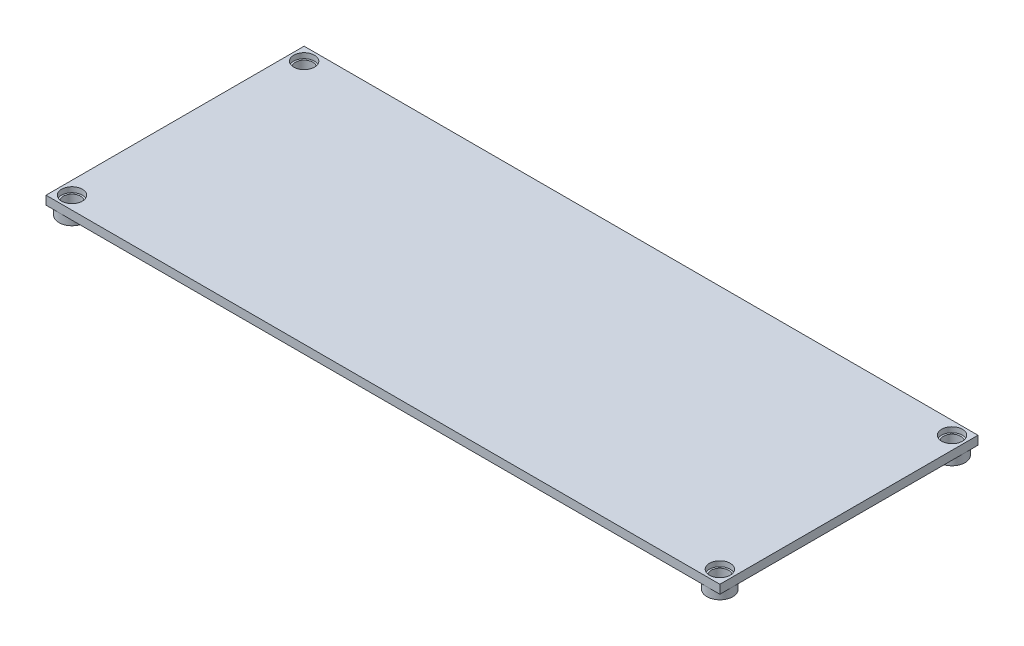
ISO-10303-21;
HEADER;
FILE_DESCRIPTION(('STEP AP214'),'2;1');
FILE_NAME('part.step','',(''),(''),'','','');
FILE_SCHEMA(('AUTOMOTIVE_DESIGN { 1 0 10303 214 1 1 1 1 }'));
ENDSEC;
DATA;
#1=APPLICATION_CONTEXT('core data for automotive mechanical design processes');
#2=APPLICATION_PROTOCOL_DEFINITION('international standard','automotive_design',2000,#1);
#3=PRODUCT_CONTEXT('',#1,'mechanical');
#4=PRODUCT('Part','Part','',(#3));
#5=PRODUCT_RELATED_PRODUCT_CATEGORY('part','',(#4));
#6=PRODUCT_DEFINITION_FORMATION('','',#4);
#7=PRODUCT_DEFINITION_CONTEXT('part definition',#1,'design');
#8=PRODUCT_DEFINITION('design','',#6,#7);
#9=PRODUCT_DEFINITION_SHAPE('','',#8);
#10=(LENGTH_UNIT() NAMED_UNIT(*) SI_UNIT(.MILLI.,.METRE.));
#11=(NAMED_UNIT(*) PLANE_ANGLE_UNIT() SI_UNIT($,.RADIAN.));
#12=(NAMED_UNIT(*) SI_UNIT($,.STERADIAN.) SOLID_ANGLE_UNIT());
#13=UNCERTAINTY_MEASURE_WITH_UNIT(LENGTH_MEASURE(1.E-05),#10,'distance_accuracy_value','');
#14=(GEOMETRIC_REPRESENTATION_CONTEXT(3) GLOBAL_UNCERTAINTY_ASSIGNED_CONTEXT((#13)) GLOBAL_UNIT_ASSIGNED_CONTEXT((#10,
#11,#12)) REPRESENTATION_CONTEXT('',''));
#15=CARTESIAN_POINT('',(0.,0.,0.));
#16=DIRECTION('',(0.,0.,1.));
#17=DIRECTION('',(1.,0.,0.));
#18=AXIS2_PLACEMENT_3D('',#15,#16,#17);
#19=CARTESIAN_POINT('',(0.,0.,0.));
#20=DIRECTION('',(0.,-1.,0.));
#21=DIRECTION('',(0.,0.,-1.));
#22=AXIS2_PLACEMENT_3D('',#19,#20,#21);
#23=PLANE('',#22);
#24=DIRECTION('',(1.,0.,0.));
#25=VECTOR('',#24,1.);
#26=CARTESIAN_POINT('',(-97.25,0.,37.25));
#27=LINE('',#26,#25);
#28=CARTESIAN_POINT('',(93.4999999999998,0.,37.25));
#29=VERTEX_POINT('',#28);
#30=CARTESIAN_POINT('',(97.25,0.,37.25));
#31=VERTEX_POINT('',#30);
#32=EDGE_CURVE('E109',#29,#31,#27,.T.);
#33=ORIENTED_EDGE('',*,*,#32,.F.);
#34=CARTESIAN_POINT('',(93.4999999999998,0.,33.5000000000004));
#35=DIRECTION('',(0.,-1.,0.));
#36=DIRECTION('',(0.,0.,-1.));
#37=AXIS2_PLACEMENT_3D('',#34,#35,#36);
#38=CIRCLE('',#37,3.75000000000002);
#39=CARTESIAN_POINT('',(97.25,0.,33.5000000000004));
#40=VERTEX_POINT('',#39);
#41=EDGE_CURVE('E49',#40,#29,#38,.T.);
#42=ORIENTED_EDGE('',*,*,#41,.F.);
#43=DIRECTION('',(0.,0.,-1.));
#44=VECTOR('',#43,1.);
#45=CARTESIAN_POINT('',(97.25,0.,37.25));
#46=LINE('',#45,#44);
#47=EDGE_CURVE('E108',#31,#40,#46,.T.);
#48=ORIENTED_EDGE('',*,*,#47,.F.);
#49=EDGE_LOOP('',(#33,#42,#48));
#50=FACE_BOUND('',#49,.T.);
#51=ADVANCED_FACE('F35',(#50),#23,.T.);
#52=CARTESIAN_POINT('',(97.2499999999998,0.,-33.5000000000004));
#53=VERTEX_POINT('',#52);
#54=EDGE_CURVE('E112',#40,#53,#46,.T.);
#55=ORIENTED_EDGE('',*,*,#54,.F.);
#56=EDGE_CURVE('E97',#29,#40,#38,.T.);
#57=ORIENTED_EDGE('',*,*,#56,.F.);
#58=CARTESIAN_POINT('',(-93.5,0.,37.25));
#59=VERTEX_POINT('',#58);
#60=EDGE_CURVE('E271',#59,#29,#27,.T.);
#61=ORIENTED_EDGE('',*,*,#60,.F.);
#62=CARTESIAN_POINT('',(-93.5,0.,33.5));
#63=DIRECTION('',(0.,-1.,0.));
#64=DIRECTION('',(0.,0.,-1.));
#65=AXIS2_PLACEMENT_3D('',#62,#63,#64);
#66=CIRCLE('',#65,3.75000000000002);
#67=CARTESIAN_POINT('',(-97.25,0.,33.5));
#68=VERTEX_POINT('',#67);
#69=EDGE_CURVE('E43',#68,#59,#66,.T.);
#70=ORIENTED_EDGE('',*,*,#69,.F.);
#71=DIRECTION('',(0.,0.,1.));
#72=VECTOR('',#71,1.);
#73=CARTESIAN_POINT('',(-97.25,0.,37.25));
#74=LINE('',#73,#72);
#75=CARTESIAN_POINT('',(-97.25,0.,-33.5));
#76=VERTEX_POINT('',#75);
#77=EDGE_CURVE('E273',#76,#68,#74,.T.);
#78=ORIENTED_EDGE('',*,*,#77,.F.);
#79=CARTESIAN_POINT('',(-93.5,0.,-33.5));
#80=DIRECTION('',(0.,-1.,0.));
#81=DIRECTION('',(0.,0.,-1.));
#82=AXIS2_PLACEMENT_3D('',#79,#80,#81);
#83=CIRCLE('',#82,3.75000000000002);
#84=CARTESIAN_POINT('',(-93.5,0.,-37.25));
#85=VERTEX_POINT('',#84);
#86=EDGE_CURVE('E188',#85,#76,#83,.T.);
#87=ORIENTED_EDGE('',*,*,#86,.F.);
#88=DIRECTION('',(-1.,0.,0.));
#89=VECTOR('',#88,1.);
#90=CARTESIAN_POINT('',(-97.25,0.,-37.25));
#91=LINE('',#90,#89);
#92=CARTESIAN_POINT('',(93.4999999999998,0.,-37.25));
#93=VERTEX_POINT('',#92);
#94=EDGE_CURVE('E125',#93,#85,#91,.T.);
#95=ORIENTED_EDGE('',*,*,#94,.F.);
#96=CARTESIAN_POINT('',(93.4999999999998,0.,-33.5000000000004));
#97=DIRECTION('',(0.,-1.,0.));
#98=DIRECTION('',(0.,0.,-1.));
#99=AXIS2_PLACEMENT_3D('',#96,#97,#98);
#100=CIRCLE('',#99,3.75000000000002);
#101=EDGE_CURVE('E11',#93,#53,#100,.F.);
#102=ORIENTED_EDGE('',*,*,#101,.T.);
#103=EDGE_LOOP('',(#55,#57,#61,#70,#78,#87,#95,#102));
#104=FACE_BOUND('',#103,.T.);
#105=ADVANCED_FACE('F113',(#104),#23,.T.);
#106=CARTESIAN_POINT('',(-97.25,0.,-37.25));
#107=VERTEX_POINT('',#106);
#108=EDGE_CURVE('E124',#85,#107,#91,.T.);
#109=ORIENTED_EDGE('',*,*,#108,.F.);
#110=EDGE_CURVE('E56',#76,#85,#83,.T.);
#111=ORIENTED_EDGE('',*,*,#110,.F.);
#112=EDGE_CURVE('E272',#107,#76,#74,.T.);
#113=ORIENTED_EDGE('',*,*,#112,.F.);
#114=EDGE_LOOP('',(#109,#111,#113));
#115=FACE_BOUND('',#114,.T.);
#116=ADVANCED_FACE('F278',(#115),#23,.T.);
#117=CARTESIAN_POINT('',(97.25,0.,-37.25));
#118=VERTEX_POINT('',#117);
#119=EDGE_CURVE('E118',#53,#118,#46,.T.);
#120=ORIENTED_EDGE('',*,*,#119,.F.);
#121=CARTESIAN_POINT('',(93.4999999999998,0.,-33.5000000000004));
#122=DIRECTION('',(0.,-1.,0.));
#123=DIRECTION('',(0.,0.,-1.));
#124=AXIS2_PLACEMENT_3D('',#121,#122,#123);
#125=CIRCLE('',#124,3.75000000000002);
#126=EDGE_CURVE('E181',#93,#53,#125,.T.);
#127=ORIENTED_EDGE('',*,*,#126,.F.);
#128=EDGE_CURVE('E127',#118,#93,#91,.T.);
#129=ORIENTED_EDGE('',*,*,#128,.F.);
#130=EDGE_LOOP('',(#120,#127,#129));
#131=FACE_BOUND('',#130,.T.);
#132=ADVANCED_FACE('F280',(#131),#23,.T.);
#133=EDGE_CURVE('E169',#59,#68,#66,.T.);
#134=ORIENTED_EDGE('',*,*,#133,.F.);
#135=CARTESIAN_POINT('',(-97.25,0.,37.25));
#136=VERTEX_POINT('',#135);
#137=EDGE_CURVE('E148',#136,#59,#27,.T.);
#138=ORIENTED_EDGE('',*,*,#137,.F.);
#139=EDGE_CURVE('E268',#68,#136,#74,.T.);
#140=ORIENTED_EDGE('',*,*,#139,.F.);
#141=EDGE_LOOP('',(#134,#138,#140));
#142=FACE_BOUND('',#141,.T.);
#143=ADVANCED_FACE('F276',(#142),#23,.T.);
#144=CARTESIAN_POINT('',(97.25,2.5,37.25));
#145=DIRECTION('',(-1.,0.,0.));
#146=DIRECTION('',(0.,0.,1.));
#147=AXIS2_PLACEMENT_3D('',#144,#145,#146);
#148=PLANE('',#147);
#149=ORIENTED_EDGE('',*,*,#47,.T.);
#150=ORIENTED_EDGE('',*,*,#54,.T.);
#151=ORIENTED_EDGE('',*,*,#119,.T.);
#152=DIRECTION('',(0.,-1.,0.));
#153=VECTOR('',#152,1.);
#154=CARTESIAN_POINT('',(97.25,2.5,-37.25));
#155=LINE('',#154,#153);
#156=CARTESIAN_POINT('',(97.25,2.5,-37.25));
#157=VERTEX_POINT('',#156);
#158=EDGE_CURVE('E163',#157,#118,#155,.T.);
#159=ORIENTED_EDGE('',*,*,#158,.F.);
#160=DIRECTION('',(0.,0.,-1.));
#161=VECTOR('',#160,1.);
#162=CARTESIAN_POINT('',(97.25,2.5,37.25));
#163=LINE('',#162,#161);
#164=CARTESIAN_POINT('',(97.25,2.5,37.25));
#165=VERTEX_POINT('',#164);
#166=EDGE_CURVE('E144',#165,#157,#163,.T.);
#167=ORIENTED_EDGE('',*,*,#166,.F.);
#168=DIRECTION('',(0.,-1.,0.));
#169=VECTOR('',#168,1.);
#170=CARTESIAN_POINT('',(97.25,2.5,37.25));
#171=LINE('',#170,#169);
#172=EDGE_CURVE('E123',#165,#31,#171,.T.);
#173=ORIENTED_EDGE('',*,*,#172,.T.);
#174=EDGE_LOOP('',(#149,#150,#151,#159,#167,#173));
#175=FACE_BOUND('',#174,.T.);
#176=ADVANCED_FACE('F37',(#175),#148,.F.);
#177=CARTESIAN_POINT('',(-97.25,2.5,-37.25));
#178=DIRECTION('',(0.,0.,1.));
#179=DIRECTION('',(1.,0.,0.));
#180=AXIS2_PLACEMENT_3D('',#177,#178,#179);
#181=PLANE('',#180);
#182=ORIENTED_EDGE('',*,*,#128,.T.);
#183=ORIENTED_EDGE('',*,*,#94,.T.);
#184=ORIENTED_EDGE('',*,*,#108,.T.);
#185=DIRECTION('',(0.,-1.,0.));
#186=VECTOR('',#185,1.);
#187=CARTESIAN_POINT('',(-97.25,2.5,-37.25));
#188=LINE('',#187,#186);
#189=CARTESIAN_POINT('',(-97.25,2.5,-37.25));
#190=VERTEX_POINT('',#189);
#191=EDGE_CURVE('E157',#190,#107,#188,.T.);
#192=ORIENTED_EDGE('',*,*,#191,.F.);
#193=DIRECTION('',(-1.,0.,0.));
#194=VECTOR('',#193,1.);
#195=CARTESIAN_POINT('',(-97.25,2.5,-37.25));
#196=LINE('',#195,#194);
#197=EDGE_CURVE('E147',#157,#190,#196,.T.);
#198=ORIENTED_EDGE('',*,*,#197,.F.);
#199=ORIENTED_EDGE('',*,*,#158,.T.);
#200=EDGE_LOOP('',(#182,#183,#184,#192,#198,#199));
#201=FACE_BOUND('',#200,.T.);
#202=ADVANCED_FACE('F260',(#201),#181,.F.);
#203=CARTESIAN_POINT('',(-97.25,2.5,37.25));
#204=DIRECTION('',(1.,0.,0.));
#205=DIRECTION('',(0.,0.,-1.));
#206=AXIS2_PLACEMENT_3D('',#203,#204,#205);
#207=PLANE('',#206);
#208=ORIENTED_EDGE('',*,*,#112,.T.);
#209=ORIENTED_EDGE('',*,*,#77,.T.);
#210=ORIENTED_EDGE('',*,*,#139,.T.);
#211=DIRECTION('',(0.,-1.,0.));
#212=VECTOR('',#211,1.);
#213=CARTESIAN_POINT('',(-97.25,2.5,37.25));
#214=LINE('',#213,#212);
#215=CARTESIAN_POINT('',(-97.25,2.5,37.25));
#216=VERTEX_POINT('',#215);
#217=EDGE_CURVE('E154',#216,#136,#214,.T.);
#218=ORIENTED_EDGE('',*,*,#217,.F.);
#219=DIRECTION('',(0.,0.,1.));
#220=VECTOR('',#219,1.);
#221=CARTESIAN_POINT('',(-97.25,2.5,37.25));
#222=LINE('',#221,#220);
#223=EDGE_CURVE('E150',#190,#216,#222,.T.);
#224=ORIENTED_EDGE('',*,*,#223,.F.);
#225=ORIENTED_EDGE('',*,*,#191,.T.);
#226=EDGE_LOOP('',(#208,#209,#210,#218,#224,#225));
#227=FACE_BOUND('',#226,.T.);
#228=ADVANCED_FACE('F266',(#227),#207,.F.);
#229=CARTESIAN_POINT('',(-97.25,2.5,37.25));
#230=DIRECTION('',(0.,0.,-1.));
#231=DIRECTION('',(-1.,0.,0.));
#232=AXIS2_PLACEMENT_3D('',#229,#230,#231);
#233=PLANE('',#232);
#234=ORIENTED_EDGE('',*,*,#137,.T.);
#235=ORIENTED_EDGE('',*,*,#60,.T.);
#236=ORIENTED_EDGE('',*,*,#32,.T.);
#237=ORIENTED_EDGE('',*,*,#172,.F.);
#238=DIRECTION('',(1.,0.,0.));
#239=VECTOR('',#238,1.);
#240=CARTESIAN_POINT('',(-97.25,2.5,37.25));
#241=LINE('',#240,#239);
#242=EDGE_CURVE('E151',#216,#165,#241,.T.);
#243=ORIENTED_EDGE('',*,*,#242,.F.);
#244=ORIENTED_EDGE('',*,*,#217,.T.);
#245=EDGE_LOOP('',(#234,#235,#236,#237,#243,#244));
#246=FACE_BOUND('',#245,.T.);
#247=ADVANCED_FACE('F253',(#246),#233,.F.);
#248=CARTESIAN_POINT('',(0.,2.5,0.));
#249=DIRECTION('',(0.,-1.,0.));
#250=DIRECTION('',(0.,0.,-1.));
#251=AXIS2_PLACEMENT_3D('',#248,#249,#250);
#252=PLANE('',#251);
#253=CARTESIAN_POINT('',(-93.5,2.5,33.5));
#254=DIRECTION('',(0.,1.,0.));
#255=DIRECTION('',(0.,0.,1.));
#256=AXIS2_PLACEMENT_3D('',#253,#254,#255);
#257=CIRCLE('',#256,3.00000000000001);
#258=CARTESIAN_POINT('',(-93.5,2.5,36.5));
#259=VERTEX_POINT('',#258);
#260=EDGE_CURVE('E179',#259,#259,#257,.T.);
#261=ORIENTED_EDGE('',*,*,#260,.F.);
#262=EDGE_LOOP('',(#261));
#263=FACE_BOUND('',#262,.T.);
#264=CARTESIAN_POINT('',(93.4999999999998,2.5,33.5000000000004));
#265=DIRECTION('',(0.,1.,0.));
#266=DIRECTION('',(0.,0.,1.));
#267=AXIS2_PLACEMENT_3D('',#264,#265,#266);
#268=CIRCLE('',#267,3.00000000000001);
#269=CARTESIAN_POINT('',(93.4999999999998,2.5,36.5000000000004));
#270=VERTEX_POINT('',#269);
#271=EDGE_CURVE('E230',#270,#270,#268,.T.);
#272=ORIENTED_EDGE('',*,*,#271,.F.);
#273=EDGE_LOOP('',(#272));
#274=FACE_BOUND('',#273,.T.);
#275=CARTESIAN_POINT('',(93.4999999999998,2.5,-33.5000000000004));
#276=DIRECTION('',(0.,1.,0.));
#277=DIRECTION('',(0.,0.,1.));
#278=AXIS2_PLACEMENT_3D('',#275,#276,#277);
#279=CIRCLE('',#278,3.00000000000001);
#280=CARTESIAN_POINT('',(93.4999999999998,2.5,-30.5000000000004));
#281=VERTEX_POINT('',#280);
#282=EDGE_CURVE('E141',#281,#281,#279,.T.);
#283=ORIENTED_EDGE('',*,*,#282,.F.);
#284=EDGE_LOOP('',(#283));
#285=FACE_BOUND('',#284,.T.);
#286=CARTESIAN_POINT('',(-93.5,2.5,-33.5));
#287=DIRECTION('',(0.,1.,0.));
#288=DIRECTION('',(0.,0.,1.));
#289=AXIS2_PLACEMENT_3D('',#286,#287,#288);
#290=CIRCLE('',#289,3.00000000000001);
#291=CARTESIAN_POINT('',(-93.5,2.5,-30.5));
#292=VERTEX_POINT('',#291);
#293=EDGE_CURVE('E133',#292,#292,#290,.T.);
#294=ORIENTED_EDGE('',*,*,#293,.F.);
#295=EDGE_LOOP('',(#294));
#296=FACE_BOUND('',#295,.T.);
#297=ORIENTED_EDGE('',*,*,#166,.T.);
#298=ORIENTED_EDGE('',*,*,#197,.T.);
#299=ORIENTED_EDGE('',*,*,#223,.T.);
#300=ORIENTED_EDGE('',*,*,#242,.T.);
#301=EDGE_LOOP('',(#297,#298,#299,#300));
#302=FACE_BOUND('',#301,.T.);
#303=ADVANCED_FACE('F249',(#263,#274,#285,#296,#302),#252,.F.);
#304=CARTESIAN_POINT('',(-93.5,1.,-33.5));
#305=DIRECTION('',(0.,1.,0.));
#306=DIRECTION('',(0.,0.,1.));
#307=AXIS2_PLACEMENT_3D('',#304,#305,#306);
#308=CYLINDRICAL_SURFACE('',#307,3.00000000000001);
#309=CARTESIAN_POINT('',(-93.5,1.,-33.5));
#310=DIRECTION('',(0.,1.,0.));
#311=DIRECTION('',(0.,0.,1.));
#312=AXIS2_PLACEMENT_3D('',#309,#310,#311);
#313=CIRCLE('',#312,3.00000000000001);
#314=CARTESIAN_POINT('',(-93.5,1.,-30.5));
#315=VERTEX_POINT('',#314);
#316=EDGE_CURVE('E129',#315,#315,#313,.T.);
#317=ORIENTED_EDGE('',*,*,#316,.F.);
#318=EDGE_LOOP('',(#317));
#319=FACE_BOUND('',#318,.T.);
#320=ORIENTED_EDGE('',*,*,#293,.T.);
#321=EDGE_LOOP('',(#320));
#322=FACE_BOUND('',#321,.T.);
#323=ADVANCED_FACE('F252',(#319,#322),#308,.F.);
#324=CARTESIAN_POINT('',(-93.5,1.,-33.5));
#325=DIRECTION('',(0.,1.,0.));
#326=DIRECTION('',(0.,0.,1.));
#327=AXIS2_PLACEMENT_3D('',#324,#325,#326);
#328=PLANE('',#327);
#329=CARTESIAN_POINT('',(-93.5,1.,-33.5));
#330=DIRECTION('',(0.,1.,0.));
#331=DIRECTION('',(0.,0.,1.));
#332=AXIS2_PLACEMENT_3D('',#329,#330,#331);
#333=CIRCLE('',#332,2.50000000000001);
#334=CARTESIAN_POINT('',(-93.5,1.,-31.));
#335=VERTEX_POINT('',#334);
#336=EDGE_CURVE('E103',#335,#335,#333,.T.);
#337=ORIENTED_EDGE('',*,*,#336,.F.);
#338=EDGE_LOOP('',(#337));
#339=FACE_BOUND('',#338,.T.);
#340=ORIENTED_EDGE('',*,*,#316,.T.);
#341=EDGE_LOOP('',(#340));
#342=FACE_BOUND('',#341,.T.);
#343=ADVANCED_FACE('F245',(#339,#342),#328,.T.);
#344=CARTESIAN_POINT('',(93.4999999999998,1.,-33.5000000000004));
#345=DIRECTION('',(0.,1.,0.));
#346=DIRECTION('',(0.,0.,1.));
#347=AXIS2_PLACEMENT_3D('',#344,#345,#346);
#348=CYLINDRICAL_SURFACE('',#347,3.00000000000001);
#349=CARTESIAN_POINT('',(93.4999999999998,1.,-33.5000000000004));
#350=DIRECTION('',(0.,1.,0.));
#351=DIRECTION('',(0.,0.,1.));
#352=AXIS2_PLACEMENT_3D('',#349,#350,#351);
#353=CIRCLE('',#352,3.00000000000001);
#354=CARTESIAN_POINT('',(93.4999999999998,1.,-30.5000000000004));
#355=VERTEX_POINT('',#354);
#356=EDGE_CURVE('E138',#355,#355,#353,.T.);
#357=ORIENTED_EDGE('',*,*,#356,.F.);
#358=EDGE_LOOP('',(#357));
#359=FACE_BOUND('',#358,.T.);
#360=ORIENTED_EDGE('',*,*,#282,.T.);
#361=EDGE_LOOP('',(#360));
#362=FACE_BOUND('',#361,.T.);
#363=ADVANCED_FACE('F242',(#359,#362),#348,.F.);
#364=CARTESIAN_POINT('',(93.4999999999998,1.,-33.5000000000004));
#365=DIRECTION('',(0.,1.,0.));
#366=DIRECTION('',(0.,0.,1.));
#367=AXIS2_PLACEMENT_3D('',#364,#365,#366);
#368=PLANE('',#367);
#369=CARTESIAN_POINT('',(93.4999999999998,1.,-33.5000000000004));
#370=DIRECTION('',(0.,1.,0.));
#371=DIRECTION('',(0.,0.,1.));
#372=AXIS2_PLACEMENT_3D('',#369,#370,#371);
#373=CIRCLE('',#372,2.50000000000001);
#374=CARTESIAN_POINT('',(93.4999999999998,1.,-31.0000000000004));
#375=VERTEX_POINT('',#374);
#376=EDGE_CURVE('E203',#375,#375,#373,.T.);
#377=ORIENTED_EDGE('',*,*,#376,.F.);
#378=EDGE_LOOP('',(#377));
#379=FACE_BOUND('',#378,.T.);
#380=ORIENTED_EDGE('',*,*,#356,.T.);
#381=EDGE_LOOP('',(#380));
#382=FACE_BOUND('',#381,.T.);
#383=ADVANCED_FACE('F240',(#379,#382),#368,.T.);
#384=CARTESIAN_POINT('',(93.4999999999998,1.,33.5000000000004));
#385=DIRECTION('',(0.,1.,0.));
#386=DIRECTION('',(0.,0.,1.));
#387=AXIS2_PLACEMENT_3D('',#384,#385,#386);
#388=CYLINDRICAL_SURFACE('',#387,3.00000000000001);
#389=CARTESIAN_POINT('',(93.4999999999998,1.,33.5000000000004));
#390=DIRECTION('',(0.,1.,0.));
#391=DIRECTION('',(0.,0.,1.));
#392=AXIS2_PLACEMENT_3D('',#389,#390,#391);
#393=CIRCLE('',#392,3.00000000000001);
#394=CARTESIAN_POINT('',(93.4999999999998,1.,36.5000000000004));
#395=VERTEX_POINT('',#394);
#396=EDGE_CURVE('E228',#395,#395,#393,.T.);
#397=ORIENTED_EDGE('',*,*,#396,.F.);
#398=EDGE_LOOP('',(#397));
#399=FACE_BOUND('',#398,.T.);
#400=ORIENTED_EDGE('',*,*,#271,.T.);
#401=EDGE_LOOP('',(#400));
#402=FACE_BOUND('',#401,.T.);
#403=ADVANCED_FACE('F224',(#399,#402),#388,.F.);
#404=CARTESIAN_POINT('',(93.4999999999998,1.,33.5000000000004));
#405=DIRECTION('',(0.,1.,0.));
#406=DIRECTION('',(0.,0.,1.));
#407=AXIS2_PLACEMENT_3D('',#404,#405,#406);
#408=PLANE('',#407);
#409=CARTESIAN_POINT('',(93.4999999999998,1.,33.5000000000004));
#410=DIRECTION('',(0.,1.,0.));
#411=DIRECTION('',(0.,0.,1.));
#412=AXIS2_PLACEMENT_3D('',#409,#410,#411);
#413=CIRCLE('',#412,2.50000000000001);
#414=CARTESIAN_POINT('',(93.4999999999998,1.,36.0000000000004));
#415=VERTEX_POINT('',#414);
#416=EDGE_CURVE('E209',#415,#415,#413,.T.);
#417=ORIENTED_EDGE('',*,*,#416,.F.);
#418=EDGE_LOOP('',(#417));
#419=FACE_BOUND('',#418,.T.);
#420=ORIENTED_EDGE('',*,*,#396,.T.);
#421=EDGE_LOOP('',(#420));
#422=FACE_BOUND('',#421,.T.);
#423=ADVANCED_FACE('F220',(#419,#422),#408,.T.);
#424=CARTESIAN_POINT('',(-93.5,1.,33.5));
#425=DIRECTION('',(0.,1.,0.));
#426=DIRECTION('',(0.,0.,1.));
#427=AXIS2_PLACEMENT_3D('',#424,#425,#426);
#428=CYLINDRICAL_SURFACE('',#427,3.00000000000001);
#429=CARTESIAN_POINT('',(-93.5,1.,33.5));
#430=DIRECTION('',(0.,1.,0.));
#431=DIRECTION('',(0.,0.,1.));
#432=AXIS2_PLACEMENT_3D('',#429,#430,#431);
#433=CIRCLE('',#432,3.00000000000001);
#434=CARTESIAN_POINT('',(-93.5,1.,36.5));
#435=VERTEX_POINT('',#434);
#436=EDGE_CURVE('E234',#435,#435,#433,.T.);
#437=ORIENTED_EDGE('',*,*,#436,.F.);
#438=EDGE_LOOP('',(#437));
#439=FACE_BOUND('',#438,.T.);
#440=ORIENTED_EDGE('',*,*,#260,.T.);
#441=EDGE_LOOP('',(#440));
#442=FACE_BOUND('',#441,.T.);
#443=ADVANCED_FACE('F223',(#439,#442),#428,.F.);
#444=CARTESIAN_POINT('',(-93.5,1.,33.5));
#445=DIRECTION('',(0.,1.,0.));
#446=DIRECTION('',(0.,0.,1.));
#447=AXIS2_PLACEMENT_3D('',#444,#445,#446);
#448=PLANE('',#447);
#449=CARTESIAN_POINT('',(-93.5,1.,33.5));
#450=DIRECTION('',(0.,1.,0.));
#451=DIRECTION('',(0.,0.,1.));
#452=AXIS2_PLACEMENT_3D('',#449,#450,#451);
#453=CIRCLE('',#452,2.50000000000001);
#454=CARTESIAN_POINT('',(-93.5,1.,36.));
#455=VERTEX_POINT('',#454);
#456=EDGE_CURVE('E197',#455,#455,#453,.T.);
#457=ORIENTED_EDGE('',*,*,#456,.F.);
#458=EDGE_LOOP('',(#457));
#459=FACE_BOUND('',#458,.T.);
#460=ORIENTED_EDGE('',*,*,#436,.T.);
#461=EDGE_LOOP('',(#460));
#462=FACE_BOUND('',#461,.T.);
#463=ADVANCED_FACE('F353',(#459,#462),#448,.T.);
#464=CARTESIAN_POINT('',(-93.5,-2.5,33.5));
#465=DIRECTION('',(0.,1.,0.));
#466=DIRECTION('',(0.,0.,1.));
#467=AXIS2_PLACEMENT_3D('',#464,#465,#466);
#468=CYLINDRICAL_SURFACE('',#467,3.75000000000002);
#469=CARTESIAN_POINT('',(-93.5,-2.5,33.5));
#470=DIRECTION('',(0.,-1.,0.));
#471=DIRECTION('',(0.,0.,-1.));
#472=AXIS2_PLACEMENT_3D('',#469,#470,#471);
#473=CIRCLE('',#472,3.75000000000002);
#474=CARTESIAN_POINT('',(-93.5,-2.5,29.75));
#475=VERTEX_POINT('',#474);
#476=EDGE_CURVE('E175',#475,#475,#473,.T.);
#477=ORIENTED_EDGE('',*,*,#476,.F.);
#478=EDGE_LOOP('',(#477));
#479=FACE_BOUND('',#478,.T.);
#480=ORIENTED_EDGE('',*,*,#133,.T.);
#481=ORIENTED_EDGE('',*,*,#69,.T.);
#482=EDGE_LOOP('',(#480,#481));
#483=FACE_BOUND('',#482,.T.);
#484=ADVANCED_FACE('F361',(#479,#483),#468,.T.);
#485=CARTESIAN_POINT('',(-93.5,-2.5,33.5));
#486=DIRECTION('',(0.,-1.,0.));
#487=DIRECTION('',(0.,0.,-1.));
#488=AXIS2_PLACEMENT_3D('',#485,#486,#487);
#489=PLANE('',#488);
#490=CARTESIAN_POINT('',(-93.5,-2.5,33.5));
#491=DIRECTION('',(0.,-1.,0.));
#492=DIRECTION('',(0.,0.,-1.));
#493=AXIS2_PLACEMENT_3D('',#490,#491,#492);
#494=CIRCLE('',#493,2.50000000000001);
#495=CARTESIAN_POINT('',(-93.5,-2.5,36.));
#496=VERTEX_POINT('',#495);
#497=EDGE_CURVE('E200',#496,#496,#494,.F.);
#498=ORIENTED_EDGE('',*,*,#497,.T.);
#499=EDGE_LOOP('',(#498));
#500=FACE_BOUND('',#499,.T.);
#501=ORIENTED_EDGE('',*,*,#476,.T.);
#502=EDGE_LOOP('',(#501));
#503=FACE_BOUND('',#502,.T.);
#504=ADVANCED_FACE('F369',(#500,#503),#489,.T.);
#505=CARTESIAN_POINT('',(93.4999999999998,-2.5,-33.5000000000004));
#506=DIRECTION('',(0.,1.,0.));
#507=DIRECTION('',(0.,0.,1.));
#508=AXIS2_PLACEMENT_3D('',#505,#506,#507);
#509=CYLINDRICAL_SURFACE('',#508,3.75000000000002);
#510=CARTESIAN_POINT('',(93.4999999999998,-2.5,-33.5000000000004));
#511=DIRECTION('',(0.,-1.,0.));
#512=DIRECTION('',(0.,0.,-1.));
#513=AXIS2_PLACEMENT_3D('',#510,#511,#512);
#514=CIRCLE('',#513,3.75000000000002);
#515=CARTESIAN_POINT('',(93.4999999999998,-2.5,-37.2500000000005));
#516=VERTEX_POINT('',#515);
#517=EDGE_CURVE('E176',#516,#516,#514,.T.);
#518=ORIENTED_EDGE('',*,*,#517,.F.);
#519=EDGE_LOOP('',(#518));
#520=FACE_BOUND('',#519,.T.);
#521=ORIENTED_EDGE('',*,*,#126,.T.);
#522=ORIENTED_EDGE('',*,*,#101,.F.);
#523=EDGE_LOOP('',(#521,#522));
#524=FACE_BOUND('',#523,.T.);
#525=ADVANCED_FACE('F377',(#520,#524),#509,.T.);
#526=CARTESIAN_POINT('',(93.4999999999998,-2.5,-33.5000000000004));
#527=DIRECTION('',(0.,-1.,0.));
#528=DIRECTION('',(0.,0.,-1.));
#529=AXIS2_PLACEMENT_3D('',#526,#527,#528);
#530=PLANE('',#529);
#531=CARTESIAN_POINT('',(93.4999999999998,-2.5,-33.5000000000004));
#532=DIRECTION('',(0.,-1.,0.));
#533=DIRECTION('',(0.,0.,-1.));
#534=AXIS2_PLACEMENT_3D('',#531,#532,#533);
#535=CIRCLE('',#534,2.50000000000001);
#536=CARTESIAN_POINT('',(93.4999999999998,-2.5,-31.0000000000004));
#537=VERTEX_POINT('',#536);
#538=EDGE_CURVE('E206',#537,#537,#535,.F.);
#539=ORIENTED_EDGE('',*,*,#538,.T.);
#540=EDGE_LOOP('',(#539));
#541=FACE_BOUND('',#540,.T.);
#542=ORIENTED_EDGE('',*,*,#517,.T.);
#543=EDGE_LOOP('',(#542));
#544=FACE_BOUND('',#543,.T.);
#545=ADVANCED_FACE('F385',(#541,#544),#530,.T.);
#546=CARTESIAN_POINT('',(-93.5,-2.5,-33.5));
#547=DIRECTION('',(0.,1.,0.));
#548=DIRECTION('',(0.,0.,1.));
#549=AXIS2_PLACEMENT_3D('',#546,#547,#548);
#550=CYLINDRICAL_SURFACE('',#549,3.75000000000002);
#551=CARTESIAN_POINT('',(-93.5,-2.5,-33.5));
#552=DIRECTION('',(0.,-1.,0.));
#553=DIRECTION('',(0.,0.,-1.));
#554=AXIS2_PLACEMENT_3D('',#551,#552,#553);
#555=CIRCLE('',#554,3.75000000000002);
#556=CARTESIAN_POINT('',(-93.5,-2.5,-37.25));
#557=VERTEX_POINT('',#556);
#558=EDGE_CURVE('E185',#557,#557,#555,.T.);
#559=ORIENTED_EDGE('',*,*,#558,.F.);
#560=EDGE_LOOP('',(#559));
#561=FACE_BOUND('',#560,.T.);
#562=ORIENTED_EDGE('',*,*,#86,.T.);
#563=ORIENTED_EDGE('',*,*,#110,.T.);
#564=EDGE_LOOP('',(#562,#563));
#565=FACE_BOUND('',#564,.T.);
#566=ADVANCED_FACE('F393',(#561,#565),#550,.T.);
#567=CARTESIAN_POINT('',(-93.5,-2.5,-33.5));
#568=DIRECTION('',(0.,-1.,0.));
#569=DIRECTION('',(0.,0.,-1.));
#570=AXIS2_PLACEMENT_3D('',#567,#568,#569);
#571=PLANE('',#570);
#572=CARTESIAN_POINT('',(-93.5,-2.5,-33.5));
#573=DIRECTION('',(0.,-1.,0.));
#574=DIRECTION('',(0.,0.,-1.));
#575=AXIS2_PLACEMENT_3D('',#572,#573,#574);
#576=CIRCLE('',#575,2.50000000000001);
#577=CARTESIAN_POINT('',(-93.5,-2.5,-31.));
#578=VERTEX_POINT('',#577);
#579=EDGE_CURVE('E194',#578,#578,#576,.F.);
#580=ORIENTED_EDGE('',*,*,#579,.T.);
#581=EDGE_LOOP('',(#580));
#582=FACE_BOUND('',#581,.T.);
#583=ORIENTED_EDGE('',*,*,#558,.T.);
#584=EDGE_LOOP('',(#583));
#585=FACE_BOUND('',#584,.T.);
#586=ADVANCED_FACE('F401',(#582,#585),#571,.T.);
#587=CARTESIAN_POINT('',(93.4999999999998,-2.5,33.5000000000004));
#588=DIRECTION('',(0.,1.,0.));
#589=DIRECTION('',(0.,0.,1.));
#590=AXIS2_PLACEMENT_3D('',#587,#588,#589);
#591=CYLINDRICAL_SURFACE('',#590,3.75000000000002);
#592=CARTESIAN_POINT('',(93.4999999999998,-2.5,33.5000000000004));
#593=DIRECTION('',(0.,-1.,0.));
#594=DIRECTION('',(0.,0.,-1.));
#595=AXIS2_PLACEMENT_3D('',#592,#593,#594);
#596=CIRCLE('',#595,3.75000000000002);
#597=CARTESIAN_POINT('',(93.4999999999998,-2.5,29.7500000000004));
#598=VERTEX_POINT('',#597);
#599=EDGE_CURVE('E111',#598,#598,#596,.T.);
#600=ORIENTED_EDGE('',*,*,#599,.F.);
#601=EDGE_LOOP('',(#600));
#602=FACE_BOUND('',#601,.T.);
#603=ORIENTED_EDGE('',*,*,#41,.T.);
#604=ORIENTED_EDGE('',*,*,#56,.T.);
#605=EDGE_LOOP('',(#603,#604));
#606=FACE_BOUND('',#605,.T.);
#607=ADVANCED_FACE('F98',(#602,#606),#591,.T.);
#608=CARTESIAN_POINT('',(93.4999999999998,-2.5,33.5000000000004));
#609=DIRECTION('',(0.,-1.,0.));
#610=DIRECTION('',(0.,0.,-1.));
#611=AXIS2_PLACEMENT_3D('',#608,#609,#610);
#612=PLANE('',#611);
#613=CARTESIAN_POINT('',(93.4999999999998,-2.5,33.5000000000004));
#614=DIRECTION('',(0.,-1.,0.));
#615=DIRECTION('',(0.,0.,-1.));
#616=AXIS2_PLACEMENT_3D('',#613,#614,#615);
#617=CIRCLE('',#616,2.50000000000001);
#618=CARTESIAN_POINT('',(93.4999999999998,-2.5,36.0000000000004));
#619=VERTEX_POINT('',#618);
#620=EDGE_CURVE('E212',#619,#619,#617,.F.);
#621=ORIENTED_EDGE('',*,*,#620,.T.);
#622=EDGE_LOOP('',(#621));
#623=FACE_BOUND('',#622,.T.);
#624=ORIENTED_EDGE('',*,*,#599,.T.);
#625=EDGE_LOOP('',(#624));
#626=FACE_BOUND('',#625,.T.);
#627=ADVANCED_FACE('F415',(#623,#626),#612,.T.);
#628=CARTESIAN_POINT('',(-93.5,-2.501,-33.5));
#629=DIRECTION('',(0.,1.,0.));
#630=DIRECTION('',(0.,0.,1.));
#631=AXIS2_PLACEMENT_3D('',#628,#629,#630);
#632=CYLINDRICAL_SURFACE('',#631,2.50000000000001);
#633=CARTESIAN_POINT('',(-93.5,-2.5,-31.));
#634=CARTESIAN_POINT('',(-93.5,-2.46354166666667,-31.));
#635=CARTESIAN_POINT('',(-93.5,-2.42708333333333,-31.));
#636=CARTESIAN_POINT('',(-93.5,-2.35416666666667,-31.));
#637=CARTESIAN_POINT('',(-93.5,-2.31770833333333,-31.));
#638=CARTESIAN_POINT('',(-93.5,-2.24479166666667,-31.));
#639=CARTESIAN_POINT('',(-93.5,-2.20833333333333,-31.));
#640=CARTESIAN_POINT('',(-93.5,-2.13541666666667,-31.));
#641=CARTESIAN_POINT('',(-93.5,-2.09895833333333,-31.));
#642=CARTESIAN_POINT('',(-93.5,-2.02604166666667,-31.));
#643=CARTESIAN_POINT('',(-93.5,-1.98958333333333,-31.));
#644=CARTESIAN_POINT('',(-93.5,-1.91666666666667,-31.));
#645=CARTESIAN_POINT('',(-93.5,-1.88020833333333,-31.));
#646=CARTESIAN_POINT('',(-93.5,-1.80729166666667,-31.));
#647=CARTESIAN_POINT('',(-93.5,-1.77083333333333,-31.));
#648=CARTESIAN_POINT('',(-93.5,-1.69791666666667,-31.));
#649=CARTESIAN_POINT('',(-93.5,-1.66145833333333,-31.));
#650=CARTESIAN_POINT('',(-93.5,-1.58854166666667,-31.));
#651=CARTESIAN_POINT('',(-93.5,-1.55208333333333,-31.));
#652=CARTESIAN_POINT('',(-93.5,-1.47916666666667,-31.));
#653=CARTESIAN_POINT('',(-93.5,-1.44270833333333,-31.));
#654=CARTESIAN_POINT('',(-93.5,-1.36979166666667,-31.));
#655=CARTESIAN_POINT('',(-93.5,-1.33333333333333,-31.));
#656=CARTESIAN_POINT('',(-93.5,-1.26041666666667,-31.));
#657=CARTESIAN_POINT('',(-93.5,-1.22395833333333,-31.));
#658=CARTESIAN_POINT('',(-93.5,-1.15104166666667,-31.));
#659=CARTESIAN_POINT('',(-93.5,-1.11458333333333,-31.));
#660=CARTESIAN_POINT('',(-93.5,-1.04166666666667,-31.));
#661=CARTESIAN_POINT('',(-93.5,-1.00520833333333,-31.));
#662=CARTESIAN_POINT('',(-93.5,-0.932291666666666,-31.));
#663=CARTESIAN_POINT('',(-93.5,-0.895833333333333,-31.));
#664=CARTESIAN_POINT('',(-93.5,-0.822916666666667,-31.));
#665=CARTESIAN_POINT('',(-93.5,-0.786458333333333,-31.));
#666=CARTESIAN_POINT('',(-93.5,-0.713541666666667,-31.));
#667=CARTESIAN_POINT('',(-93.5,-0.677083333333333,-31.));
#668=CARTESIAN_POINT('',(-93.5,-0.604166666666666,-31.));
#669=CARTESIAN_POINT('',(-93.5,-0.567708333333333,-31.));
#670=CARTESIAN_POINT('',(-93.5,-0.494791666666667,-31.));
#671=CARTESIAN_POINT('',(-93.5,-0.458333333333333,-31.));
#672=CARTESIAN_POINT('',(-93.5,-0.385416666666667,-31.));
#673=CARTESIAN_POINT('',(-93.5,-0.348958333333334,-31.));
#674=CARTESIAN_POINT('',(-93.5,-0.276041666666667,-31.));
#675=CARTESIAN_POINT('',(-93.5,-0.239583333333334,-31.));
#676=CARTESIAN_POINT('',(-93.5,-0.166666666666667,-31.));
#677=CARTESIAN_POINT('',(-93.5,-0.130208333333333,-31.));
#678=CARTESIAN_POINT('',(-93.5,-0.0572916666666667,-31.));
#679=CARTESIAN_POINT('',(-93.5,-0.0208333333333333,-31.));
#680=CARTESIAN_POINT('',(-93.5,0.0520833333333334,-31.));
#681=CARTESIAN_POINT('',(-93.5,0.0885416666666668,-31.));
#682=CARTESIAN_POINT('',(-93.5,0.161458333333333,-31.));
#683=CARTESIAN_POINT('',(-93.5,0.197916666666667,-31.));
#684=CARTESIAN_POINT('',(-93.5,0.270833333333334,-31.));
#685=CARTESIAN_POINT('',(-93.5,0.307291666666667,-31.));
#686=CARTESIAN_POINT('',(-93.5,0.380208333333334,-31.));
#687=CARTESIAN_POINT('',(-93.5,0.416666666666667,-31.));
#688=CARTESIAN_POINT('',(-93.5,0.489583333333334,-31.));
#689=CARTESIAN_POINT('',(-93.5,0.526041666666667,-31.));
#690=CARTESIAN_POINT('',(-93.5,0.598958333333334,-31.));
#691=CARTESIAN_POINT('',(-93.5,0.635416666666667,-31.));
#692=CARTESIAN_POINT('',(-93.5,0.708333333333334,-31.));
#693=CARTESIAN_POINT('',(-93.5,0.744791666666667,-31.));
#694=CARTESIAN_POINT('',(-93.5,0.817708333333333,-31.));
#695=CARTESIAN_POINT('',(-93.5,0.854166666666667,-31.));
#696=CARTESIAN_POINT('',(-93.5,0.927083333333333,-31.));
#697=CARTESIAN_POINT('',(-93.5,0.963541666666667,-31.));
#698=CARTESIAN_POINT('',(-93.5,1.,-31.));
#699=B_SPLINE_CURVE_WITH_KNOTS('',3,(#633,#634,#635,#636,#637,#638,#639,#640,#641,#642,#643,
#644,#645,#646,#647,#648,#649,#650,#651,#652,#653,#654,#655,#656,#657,#658,#659,#660,#661,#662,
#663,#664,#665,#666,#667,#668,#669,#670,#671,#672,#673,#674,#675,#676,#677,#678,#679,#680,#681,
#682,#683,#684,#685,#686,#687,#688,#689,#690,#691,#692,#693,#694,#695,#696,#697,#698),
.UNSPECIFIED.,.F.,.F.,(4,2,2,2,2,2,2,2,2,2,2,2,2,2,2,2,2,2,2,2,2,2,2,2,2,2,2,2,2,2,2,2,4),(0.,
0.109375,0.21875,0.328125,0.4375,0.546875,0.65625,0.765625,0.875,0.984375,1.09375,1.203125,
1.3125,1.421875,1.53125,1.640625,1.75,1.859375,1.96875,2.078125,2.1875,2.296875,2.40625,
2.515625,2.625,2.734375,2.84375,2.953125,3.0625,3.171875,3.28125,3.390625,3.5),.UNSPECIFIED.);
#700=EDGE_CURVE('BSEAM422',#578,#335,#699,.T.);
#701=ORIENTED_EDGE('',*,*,#579,.F.);
#702=ORIENTED_EDGE('',*,*,#336,.T.);
#703=ORIENTED_EDGE('',*,*,#700,.T.);
#704=ORIENTED_EDGE('',*,*,#700,.F.);
#705=EDGE_LOOP('',(#701,#703,#702,#704));
#706=FACE_BOUND('',#705,.T.);
#707=ADVANCED_FACE('F422',(#706),#632,.F.);
#708=CARTESIAN_POINT('',(-93.5,-2.501,33.5));
#709=DIRECTION('',(0.,1.,0.));
#710=DIRECTION('',(0.,0.,1.));
#711=AXIS2_PLACEMENT_3D('',#708,#709,#710);
#712=CYLINDRICAL_SURFACE('',#711,2.50000000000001);
#713=CARTESIAN_POINT('',(-93.5,-2.5,36.));
#714=CARTESIAN_POINT('',(-93.5,-2.46354166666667,36.));
#715=CARTESIAN_POINT('',(-93.5,-2.42708333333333,36.));
#716=CARTESIAN_POINT('',(-93.5,-2.35416666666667,36.));
#717=CARTESIAN_POINT('',(-93.5,-2.31770833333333,36.));
#718=CARTESIAN_POINT('',(-93.5,-2.24479166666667,36.));
#719=CARTESIAN_POINT('',(-93.5,-2.20833333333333,36.));
#720=CARTESIAN_POINT('',(-93.5,-2.13541666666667,36.));
#721=CARTESIAN_POINT('',(-93.5,-2.09895833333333,36.));
#722=CARTESIAN_POINT('',(-93.5,-2.02604166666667,36.));
#723=CARTESIAN_POINT('',(-93.5,-1.98958333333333,36.));
#724=CARTESIAN_POINT('',(-93.5,-1.91666666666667,36.));
#725=CARTESIAN_POINT('',(-93.5,-1.88020833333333,36.));
#726=CARTESIAN_POINT('',(-93.5,-1.80729166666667,36.));
#727=CARTESIAN_POINT('',(-93.5,-1.77083333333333,36.));
#728=CARTESIAN_POINT('',(-93.5,-1.69791666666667,36.));
#729=CARTESIAN_POINT('',(-93.5,-1.66145833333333,36.));
#730=CARTESIAN_POINT('',(-93.5,-1.58854166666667,36.));
#731=CARTESIAN_POINT('',(-93.5,-1.55208333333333,36.));
#732=CARTESIAN_POINT('',(-93.5,-1.47916666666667,36.));
#733=CARTESIAN_POINT('',(-93.5,-1.44270833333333,36.));
#734=CARTESIAN_POINT('',(-93.5,-1.36979166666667,36.));
#735=CARTESIAN_POINT('',(-93.5,-1.33333333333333,36.));
#736=CARTESIAN_POINT('',(-93.5,-1.26041666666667,36.));
#737=CARTESIAN_POINT('',(-93.5,-1.22395833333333,36.));
#738=CARTESIAN_POINT('',(-93.5,-1.15104166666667,36.));
#739=CARTESIAN_POINT('',(-93.5,-1.11458333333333,36.));
#740=CARTESIAN_POINT('',(-93.5,-1.04166666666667,36.));
#741=CARTESIAN_POINT('',(-93.5,-1.00520833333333,36.));
#742=CARTESIAN_POINT('',(-93.5,-0.932291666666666,36.));
#743=CARTESIAN_POINT('',(-93.5,-0.895833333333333,36.));
#744=CARTESIAN_POINT('',(-93.5,-0.822916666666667,36.));
#745=CARTESIAN_POINT('',(-93.5,-0.786458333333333,36.));
#746=CARTESIAN_POINT('',(-93.5,-0.713541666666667,36.));
#747=CARTESIAN_POINT('',(-93.5,-0.677083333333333,36.));
#748=CARTESIAN_POINT('',(-93.5,-0.604166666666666,36.));
#749=CARTESIAN_POINT('',(-93.5,-0.567708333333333,36.));
#750=CARTESIAN_POINT('',(-93.5,-0.494791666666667,36.));
#751=CARTESIAN_POINT('',(-93.5,-0.458333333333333,36.));
#752=CARTESIAN_POINT('',(-93.5,-0.385416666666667,36.));
#753=CARTESIAN_POINT('',(-93.5,-0.348958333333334,36.));
#754=CARTESIAN_POINT('',(-93.5,-0.276041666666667,36.));
#755=CARTESIAN_POINT('',(-93.5,-0.239583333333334,36.));
#756=CARTESIAN_POINT('',(-93.5,-0.166666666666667,36.));
#757=CARTESIAN_POINT('',(-93.5,-0.130208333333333,36.));
#758=CARTESIAN_POINT('',(-93.5,-0.0572916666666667,36.));
#759=CARTESIAN_POINT('',(-93.5,-0.0208333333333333,36.));
#760=CARTESIAN_POINT('',(-93.5,0.0520833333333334,36.));
#761=CARTESIAN_POINT('',(-93.5,0.0885416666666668,36.));
#762=CARTESIAN_POINT('',(-93.5,0.161458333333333,36.));
#763=CARTESIAN_POINT('',(-93.5,0.197916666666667,36.));
#764=CARTESIAN_POINT('',(-93.5,0.270833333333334,36.));
#765=CARTESIAN_POINT('',(-93.5,0.307291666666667,36.));
#766=CARTESIAN_POINT('',(-93.5,0.380208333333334,36.));
#767=CARTESIAN_POINT('',(-93.5,0.416666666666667,36.));
#768=CARTESIAN_POINT('',(-93.5,0.489583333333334,36.));
#769=CARTESIAN_POINT('',(-93.5,0.526041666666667,36.));
#770=CARTESIAN_POINT('',(-93.5,0.598958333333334,36.));
#771=CARTESIAN_POINT('',(-93.5,0.635416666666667,36.));
#772=CARTESIAN_POINT('',(-93.5,0.708333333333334,36.));
#773=CARTESIAN_POINT('',(-93.5,0.744791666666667,36.));
#774=CARTESIAN_POINT('',(-93.5,0.817708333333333,36.));
#775=CARTESIAN_POINT('',(-93.5,0.854166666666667,36.));
#776=CARTESIAN_POINT('',(-93.5,0.927083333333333,36.));
#777=CARTESIAN_POINT('',(-93.5,0.963541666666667,36.));
#778=CARTESIAN_POINT('',(-93.5,1.,36.));
#779=B_SPLINE_CURVE_WITH_KNOTS('',3,(#713,#714,#715,#716,#717,#718,#719,#720,#721,#722,#723,
#724,#725,#726,#727,#728,#729,#730,#731,#732,#733,#734,#735,#736,#737,#738,#739,#740,#741,#742,
#743,#744,#745,#746,#747,#748,#749,#750,#751,#752,#753,#754,#755,#756,#757,#758,#759,#760,#761,
#762,#763,#764,#765,#766,#767,#768,#769,#770,#771,#772,#773,#774,#775,#776,#777,#778),
.UNSPECIFIED.,.F.,.F.,(4,2,2,2,2,2,2,2,2,2,2,2,2,2,2,2,2,2,2,2,2,2,2,2,2,2,2,2,2,2,2,2,4),(0.,
0.109375,0.21875,0.328125,0.4375,0.546875,0.65625,0.765625,0.875,0.984375,1.09375,1.203125,
1.3125,1.421875,1.53125,1.640625,1.75,1.859375,1.96875,2.078125,2.1875,2.296875,2.40625,
2.515625,2.625,2.734375,2.84375,2.953125,3.0625,3.171875,3.28125,3.390625,3.5),.UNSPECIFIED.);
#780=EDGE_CURVE('BSEAM430',#496,#455,#779,.T.);
#781=ORIENTED_EDGE('',*,*,#497,.F.);
#782=ORIENTED_EDGE('',*,*,#456,.T.);
#783=ORIENTED_EDGE('',*,*,#780,.T.);
#784=ORIENTED_EDGE('',*,*,#780,.F.);
#785=EDGE_LOOP('',(#781,#783,#782,#784));
#786=FACE_BOUND('',#785,.T.);
#787=ADVANCED_FACE('F430',(#786),#712,.F.);
#788=CARTESIAN_POINT('',(93.4999999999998,-2.501,-33.5000000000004));
#789=DIRECTION('',(0.,1.,0.));
#790=DIRECTION('',(0.,0.,1.));
#791=AXIS2_PLACEMENT_3D('',#788,#789,#790);
#792=CYLINDRICAL_SURFACE('',#791,2.50000000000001);
#793=CARTESIAN_POINT('',(93.4999999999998,-2.5,-31.0000000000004));
#794=CARTESIAN_POINT('',(93.4999999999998,-2.46354166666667,-31.0000000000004));
#795=CARTESIAN_POINT('',(93.4999999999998,-2.42708333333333,-31.0000000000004));
#796=CARTESIAN_POINT('',(93.4999999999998,-2.35416666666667,-31.0000000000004));
#797=CARTESIAN_POINT('',(93.4999999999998,-2.31770833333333,-31.0000000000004));
#798=CARTESIAN_POINT('',(93.4999999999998,-2.24479166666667,-31.0000000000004));
#799=CARTESIAN_POINT('',(93.4999999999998,-2.20833333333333,-31.0000000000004));
#800=CARTESIAN_POINT('',(93.4999999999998,-2.13541666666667,-31.0000000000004));
#801=CARTESIAN_POINT('',(93.4999999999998,-2.09895833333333,-31.0000000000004));
#802=CARTESIAN_POINT('',(93.4999999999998,-2.02604166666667,-31.0000000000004));
#803=CARTESIAN_POINT('',(93.4999999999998,-1.98958333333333,-31.0000000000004));
#804=CARTESIAN_POINT('',(93.4999999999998,-1.91666666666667,-31.0000000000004));
#805=CARTESIAN_POINT('',(93.4999999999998,-1.88020833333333,-31.0000000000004));
#806=CARTESIAN_POINT('',(93.4999999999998,-1.80729166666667,-31.0000000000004));
#807=CARTESIAN_POINT('',(93.4999999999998,-1.77083333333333,-31.0000000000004));
#808=CARTESIAN_POINT('',(93.4999999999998,-1.69791666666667,-31.0000000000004));
#809=CARTESIAN_POINT('',(93.4999999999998,-1.66145833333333,-31.0000000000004));
#810=CARTESIAN_POINT('',(93.4999999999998,-1.58854166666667,-31.0000000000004));
#811=CARTESIAN_POINT('',(93.4999999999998,-1.55208333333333,-31.0000000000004));
#812=CARTESIAN_POINT('',(93.4999999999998,-1.47916666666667,-31.0000000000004));
#813=CARTESIAN_POINT('',(93.4999999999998,-1.44270833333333,-31.0000000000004));
#814=CARTESIAN_POINT('',(93.4999999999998,-1.36979166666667,-31.0000000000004));
#815=CARTESIAN_POINT('',(93.4999999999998,-1.33333333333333,-31.0000000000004));
#816=CARTESIAN_POINT('',(93.4999999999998,-1.26041666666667,-31.0000000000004));
#817=CARTESIAN_POINT('',(93.4999999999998,-1.22395833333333,-31.0000000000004));
#818=CARTESIAN_POINT('',(93.4999999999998,-1.15104166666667,-31.0000000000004));
#819=CARTESIAN_POINT('',(93.4999999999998,-1.11458333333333,-31.0000000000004));
#820=CARTESIAN_POINT('',(93.4999999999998,-1.04166666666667,-31.0000000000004));
#821=CARTESIAN_POINT('',(93.4999999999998,-1.00520833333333,-31.0000000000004));
#822=CARTESIAN_POINT('',(93.4999999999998,-0.932291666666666,-31.0000000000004));
#823=CARTESIAN_POINT('',(93.4999999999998,-0.895833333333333,-31.0000000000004));
#824=CARTESIAN_POINT('',(93.4999999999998,-0.822916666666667,-31.0000000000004));
#825=CARTESIAN_POINT('',(93.4999999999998,-0.786458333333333,-31.0000000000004));
#826=CARTESIAN_POINT('',(93.4999999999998,-0.713541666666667,-31.0000000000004));
#827=CARTESIAN_POINT('',(93.4999999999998,-0.677083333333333,-31.0000000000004));
#828=CARTESIAN_POINT('',(93.4999999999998,-0.604166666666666,-31.0000000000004));
#829=CARTESIAN_POINT('',(93.4999999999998,-0.567708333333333,-31.0000000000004));
#830=CARTESIAN_POINT('',(93.4999999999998,-0.494791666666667,-31.0000000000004));
#831=CARTESIAN_POINT('',(93.4999999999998,-0.458333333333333,-31.0000000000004));
#832=CARTESIAN_POINT('',(93.4999999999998,-0.385416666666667,-31.0000000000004));
#833=CARTESIAN_POINT('',(93.4999999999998,-0.348958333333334,-31.0000000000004));
#834=CARTESIAN_POINT('',(93.4999999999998,-0.276041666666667,-31.0000000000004));
#835=CARTESIAN_POINT('',(93.4999999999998,-0.239583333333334,-31.0000000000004));
#836=CARTESIAN_POINT('',(93.4999999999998,-0.166666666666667,-31.0000000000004));
#837=CARTESIAN_POINT('',(93.4999999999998,-0.130208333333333,-31.0000000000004));
#838=CARTESIAN_POINT('',(93.4999999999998,-0.0572916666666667,-31.0000000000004));
#839=CARTESIAN_POINT('',(93.4999999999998,-0.0208333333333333,-31.0000000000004));
#840=CARTESIAN_POINT('',(93.4999999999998,0.0520833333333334,-31.0000000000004));
#841=CARTESIAN_POINT('',(93.4999999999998,0.0885416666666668,-31.0000000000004));
#842=CARTESIAN_POINT('',(93.4999999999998,0.161458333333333,-31.0000000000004));
#843=CARTESIAN_POINT('',(93.4999999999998,0.197916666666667,-31.0000000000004));
#844=CARTESIAN_POINT('',(93.4999999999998,0.270833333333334,-31.0000000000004));
#845=CARTESIAN_POINT('',(93.4999999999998,0.307291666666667,-31.0000000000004));
#846=CARTESIAN_POINT('',(93.4999999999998,0.380208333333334,-31.0000000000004));
#847=CARTESIAN_POINT('',(93.4999999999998,0.416666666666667,-31.0000000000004));
#848=CARTESIAN_POINT('',(93.4999999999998,0.489583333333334,-31.0000000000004));
#849=CARTESIAN_POINT('',(93.4999999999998,0.526041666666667,-31.0000000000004));
#850=CARTESIAN_POINT('',(93.4999999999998,0.598958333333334,-31.0000000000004));
#851=CARTESIAN_POINT('',(93.4999999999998,0.635416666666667,-31.0000000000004));
#852=CARTESIAN_POINT('',(93.4999999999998,0.708333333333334,-31.0000000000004));
#853=CARTESIAN_POINT('',(93.4999999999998,0.744791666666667,-31.0000000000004));
#854=CARTESIAN_POINT('',(93.4999999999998,0.817708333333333,-31.0000000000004));
#855=CARTESIAN_POINT('',(93.4999999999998,0.854166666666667,-31.0000000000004));
#856=CARTESIAN_POINT('',(93.4999999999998,0.927083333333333,-31.0000000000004));
#857=CARTESIAN_POINT('',(93.4999999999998,0.963541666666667,-31.0000000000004));
#858=CARTESIAN_POINT('',(93.4999999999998,1.,-31.0000000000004));
#859=B_SPLINE_CURVE_WITH_KNOTS('',3,(#793,#794,#795,#796,#797,#798,#799,#800,#801,#802,#803,
#804,#805,#806,#807,#808,#809,#810,#811,#812,#813,#814,#815,#816,#817,#818,#819,#820,#821,#822,
#823,#824,#825,#826,#827,#828,#829,#830,#831,#832,#833,#834,#835,#836,#837,#838,#839,#840,#841,
#842,#843,#844,#845,#846,#847,#848,#849,#850,#851,#852,#853,#854,#855,#856,#857,#858),
.UNSPECIFIED.,.F.,.F.,(4,2,2,2,2,2,2,2,2,2,2,2,2,2,2,2,2,2,2,2,2,2,2,2,2,2,2,2,2,2,2,2,4),(0.,
0.109375,0.21875,0.328125,0.4375,0.546875,0.65625,0.765625,0.875,0.984375,1.09375,1.203125,
1.3125,1.421875,1.53125,1.640625,1.75,1.859375,1.96875,2.078125,2.1875,2.296875,2.40625,
2.515625,2.625,2.734375,2.84375,2.953125,3.0625,3.171875,3.28125,3.390625,3.5),.UNSPECIFIED.);
#860=EDGE_CURVE('BSEAM438',#537,#375,#859,.T.);
#861=ORIENTED_EDGE('',*,*,#538,.F.);
#862=ORIENTED_EDGE('',*,*,#376,.T.);
#863=ORIENTED_EDGE('',*,*,#860,.T.);
#864=ORIENTED_EDGE('',*,*,#860,.F.);
#865=EDGE_LOOP('',(#861,#863,#862,#864));
#866=FACE_BOUND('',#865,.T.);
#867=ADVANCED_FACE('F438',(#866),#792,.F.);
#868=CARTESIAN_POINT('',(93.4999999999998,-2.501,33.5000000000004));
#869=DIRECTION('',(0.,1.,0.));
#870=DIRECTION('',(0.,0.,1.));
#871=AXIS2_PLACEMENT_3D('',#868,#869,#870);
#872=CYLINDRICAL_SURFACE('',#871,2.50000000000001);
#873=CARTESIAN_POINT('',(93.4999999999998,-2.5,36.0000000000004));
#874=CARTESIAN_POINT('',(93.4999999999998,-2.46354166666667,36.0000000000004));
#875=CARTESIAN_POINT('',(93.4999999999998,-2.42708333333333,36.0000000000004));
#876=CARTESIAN_POINT('',(93.4999999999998,-2.35416666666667,36.0000000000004));
#877=CARTESIAN_POINT('',(93.4999999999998,-2.31770833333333,36.0000000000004));
#878=CARTESIAN_POINT('',(93.4999999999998,-2.24479166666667,36.0000000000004));
#879=CARTESIAN_POINT('',(93.4999999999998,-2.20833333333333,36.0000000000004));
#880=CARTESIAN_POINT('',(93.4999999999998,-2.13541666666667,36.0000000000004));
#881=CARTESIAN_POINT('',(93.4999999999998,-2.09895833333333,36.0000000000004));
#882=CARTESIAN_POINT('',(93.4999999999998,-2.02604166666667,36.0000000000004));
#883=CARTESIAN_POINT('',(93.4999999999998,-1.98958333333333,36.0000000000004));
#884=CARTESIAN_POINT('',(93.4999999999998,-1.91666666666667,36.0000000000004));
#885=CARTESIAN_POINT('',(93.4999999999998,-1.88020833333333,36.0000000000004));
#886=CARTESIAN_POINT('',(93.4999999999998,-1.80729166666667,36.0000000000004));
#887=CARTESIAN_POINT('',(93.4999999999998,-1.77083333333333,36.0000000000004));
#888=CARTESIAN_POINT('',(93.4999999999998,-1.69791666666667,36.0000000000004));
#889=CARTESIAN_POINT('',(93.4999999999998,-1.66145833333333,36.0000000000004));
#890=CARTESIAN_POINT('',(93.4999999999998,-1.58854166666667,36.0000000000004));
#891=CARTESIAN_POINT('',(93.4999999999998,-1.55208333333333,36.0000000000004));
#892=CARTESIAN_POINT('',(93.4999999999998,-1.47916666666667,36.0000000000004));
#893=CARTESIAN_POINT('',(93.4999999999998,-1.44270833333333,36.0000000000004));
#894=CARTESIAN_POINT('',(93.4999999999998,-1.36979166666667,36.0000000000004));
#895=CARTESIAN_POINT('',(93.4999999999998,-1.33333333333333,36.0000000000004));
#896=CARTESIAN_POINT('',(93.4999999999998,-1.26041666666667,36.0000000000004));
#897=CARTESIAN_POINT('',(93.4999999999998,-1.22395833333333,36.0000000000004));
#898=CARTESIAN_POINT('',(93.4999999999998,-1.15104166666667,36.0000000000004));
#899=CARTESIAN_POINT('',(93.4999999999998,-1.11458333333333,36.0000000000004));
#900=CARTESIAN_POINT('',(93.4999999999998,-1.04166666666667,36.0000000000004));
#901=CARTESIAN_POINT('',(93.4999999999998,-1.00520833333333,36.0000000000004));
#902=CARTESIAN_POINT('',(93.4999999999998,-0.932291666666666,36.0000000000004));
#903=CARTESIAN_POINT('',(93.4999999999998,-0.895833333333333,36.0000000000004));
#904=CARTESIAN_POINT('',(93.4999999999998,-0.822916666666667,36.0000000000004));
#905=CARTESIAN_POINT('',(93.4999999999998,-0.786458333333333,36.0000000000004));
#906=CARTESIAN_POINT('',(93.4999999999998,-0.713541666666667,36.0000000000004));
#907=CARTESIAN_POINT('',(93.4999999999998,-0.677083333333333,36.0000000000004));
#908=CARTESIAN_POINT('',(93.4999999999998,-0.604166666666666,36.0000000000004));
#909=CARTESIAN_POINT('',(93.4999999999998,-0.567708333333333,36.0000000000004));
#910=CARTESIAN_POINT('',(93.4999999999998,-0.494791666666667,36.0000000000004));
#911=CARTESIAN_POINT('',(93.4999999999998,-0.458333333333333,36.0000000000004));
#912=CARTESIAN_POINT('',(93.4999999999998,-0.385416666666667,36.0000000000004));
#913=CARTESIAN_POINT('',(93.4999999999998,-0.348958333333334,36.0000000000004));
#914=CARTESIAN_POINT('',(93.4999999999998,-0.276041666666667,36.0000000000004));
#915=CARTESIAN_POINT('',(93.4999999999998,-0.239583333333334,36.0000000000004));
#916=CARTESIAN_POINT('',(93.4999999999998,-0.166666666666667,36.0000000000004));
#917=CARTESIAN_POINT('',(93.4999999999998,-0.130208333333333,36.0000000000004));
#918=CARTESIAN_POINT('',(93.4999999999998,-0.0572916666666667,36.0000000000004));
#919=CARTESIAN_POINT('',(93.4999999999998,-0.0208333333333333,36.0000000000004));
#920=CARTESIAN_POINT('',(93.4999999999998,0.0520833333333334,36.0000000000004));
#921=CARTESIAN_POINT('',(93.4999999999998,0.0885416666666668,36.0000000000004));
#922=CARTESIAN_POINT('',(93.4999999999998,0.161458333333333,36.0000000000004));
#923=CARTESIAN_POINT('',(93.4999999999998,0.197916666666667,36.0000000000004));
#924=CARTESIAN_POINT('',(93.4999999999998,0.270833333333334,36.0000000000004));
#925=CARTESIAN_POINT('',(93.4999999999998,0.307291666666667,36.0000000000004));
#926=CARTESIAN_POINT('',(93.4999999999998,0.380208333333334,36.0000000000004));
#927=CARTESIAN_POINT('',(93.4999999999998,0.416666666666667,36.0000000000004));
#928=CARTESIAN_POINT('',(93.4999999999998,0.489583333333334,36.0000000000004));
#929=CARTESIAN_POINT('',(93.4999999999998,0.526041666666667,36.0000000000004));
#930=CARTESIAN_POINT('',(93.4999999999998,0.598958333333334,36.0000000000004));
#931=CARTESIAN_POINT('',(93.4999999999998,0.635416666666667,36.0000000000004));
#932=CARTESIAN_POINT('',(93.4999999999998,0.708333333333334,36.0000000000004));
#933=CARTESIAN_POINT('',(93.4999999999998,0.744791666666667,36.0000000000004));
#934=CARTESIAN_POINT('',(93.4999999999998,0.817708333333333,36.0000000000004));
#935=CARTESIAN_POINT('',(93.4999999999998,0.854166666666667,36.0000000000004));
#936=CARTESIAN_POINT('',(93.4999999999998,0.927083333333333,36.0000000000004));
#937=CARTESIAN_POINT('',(93.4999999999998,0.963541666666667,36.0000000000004));
#938=CARTESIAN_POINT('',(93.4999999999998,1.,36.0000000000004));
#939=B_SPLINE_CURVE_WITH_KNOTS('',3,(#873,#874,#875,#876,#877,#878,#879,#880,#881,#882,#883,
#884,#885,#886,#887,#888,#889,#890,#891,#892,#893,#894,#895,#896,#897,#898,#899,#900,#901,#902,
#903,#904,#905,#906,#907,#908,#909,#910,#911,#912,#913,#914,#915,#916,#917,#918,#919,#920,#921,
#922,#923,#924,#925,#926,#927,#928,#929,#930,#931,#932,#933,#934,#935,#936,#937,#938),
.UNSPECIFIED.,.F.,.F.,(4,2,2,2,2,2,2,2,2,2,2,2,2,2,2,2,2,2,2,2,2,2,2,2,2,2,2,2,2,2,2,2,4),(0.,
0.109375,0.21875,0.328125,0.4375,0.546875,0.65625,0.765625,0.875,0.984375,1.09375,1.203125,
1.3125,1.421875,1.53125,1.640625,1.75,1.859375,1.96875,2.078125,2.1875,2.296875,2.40625,
2.515625,2.625,2.734375,2.84375,2.953125,3.0625,3.171875,3.28125,3.390625,3.5),.UNSPECIFIED.);
#940=EDGE_CURVE('BSEAM218',#619,#415,#939,.T.);
#941=ORIENTED_EDGE('',*,*,#620,.F.);
#942=ORIENTED_EDGE('',*,*,#416,.T.);
#943=ORIENTED_EDGE('',*,*,#940,.T.);
#944=ORIENTED_EDGE('',*,*,#940,.F.);
#945=EDGE_LOOP('',(#941,#943,#942,#944));
#946=FACE_BOUND('',#945,.T.);
#947=ADVANCED_FACE('F218',(#946),#872,.F.);
#948=CLOSED_SHELL('',(#51,#105,#116,#132,#143,#176,#202,#228,#247,#303,#323,#343,#363,#383,#403,
#423,#443,#463,#484,#504,#525,#545,#566,#586,#607,#627,#707,#787,#867,#947));
#949=MANIFOLD_SOLID_BREP('B2',#948);
#950=ADVANCED_BREP_SHAPE_REPRESENTATION('',(#18,#949),#14);
#951=SHAPE_DEFINITION_REPRESENTATION(#9,#950);
ENDSEC;
END-ISO-10303-21;
